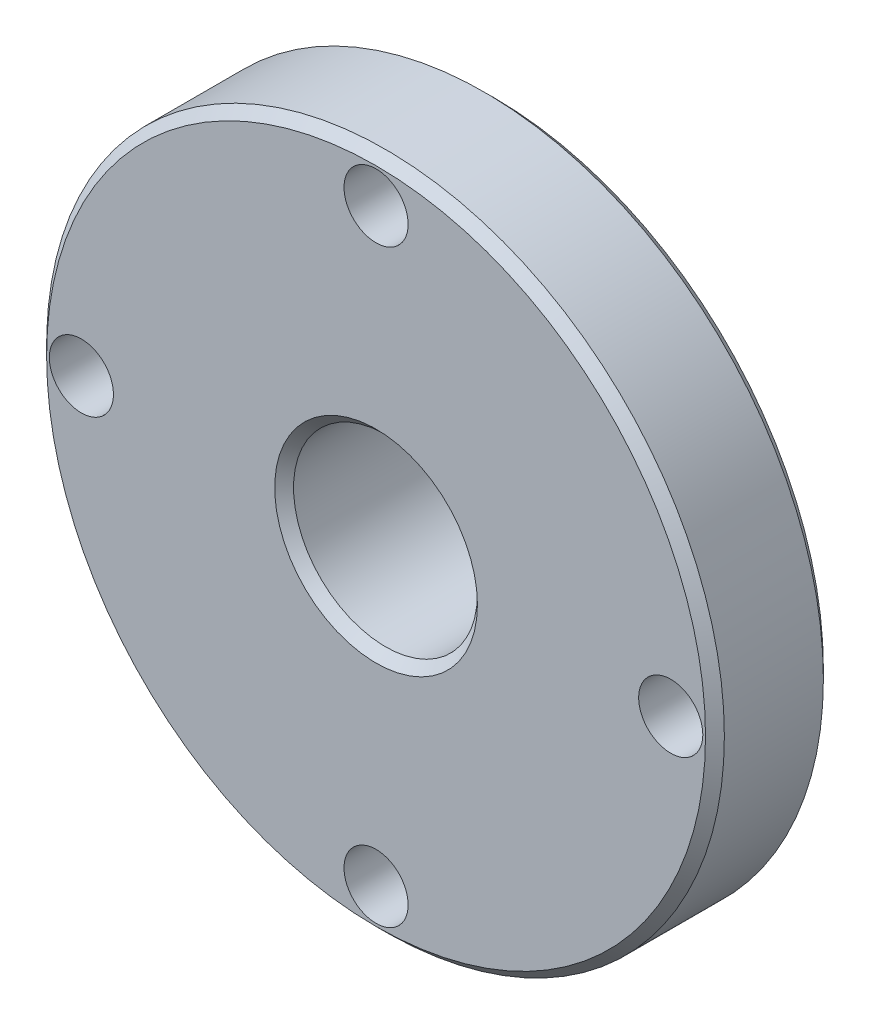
from build123d import *

# Parameters (mm, degrees)
SKETCH1_R          = 18.25625
EXTRUDE1_DEPTH     = 6.35
SKETCH2_R          = 1.7272
SCREW_HOLES_DEPTH  = 6.35
SKETCH3_R          = 4.953
CONN_HOLE_DEPTH    = 27.587663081
SKETCH4_R          = 9.4615
SKETCH4_R_2        = 4.953
LOCATOR_BOSS_DEPTH = 2.032
EDGES_2_SIZE       = 0.508


with BuildPart() as part:
    # Sketch1 → Extrude1 (new body)
    with BuildSketch(Plane.XY):
        Circle(SKETCH1_R)
    extrude(amount=EXTRUDE1_DEPTH)

    # Sketch2 → screw holes (cut)
    with BuildSketch(Plane.XY.offset(6.35)):
        with Locations((0, 15.875)):
            Circle(SKETCH2_R)
        with Locations((-15.875, 0)):
            Circle(SKETCH2_R)
        with Locations((0, -15.875)):
            Circle(SKETCH2_R)
        with Locations((15.875, 0)):
            Circle(SKETCH2_R)
    extrude(amount=-SCREW_HOLES_DEPTH, mode=Mode.SUBTRACT)

    # Sketch3 → conn hole (cut, through all)
    with BuildSketch(Plane.XY.offset(6.35)):
        Circle(SKETCH3_R)
    extrude(amount=-CONN_HOLE_DEPTH, mode=Mode.SUBTRACT)

    # Sketch4 → locator boss (add)
    with BuildSketch(Plane(origin=(0, 0, 0), x_dir=(-1, 0, 0), z_dir=(0, 0, -1))):
        with Locations(Location((0, 0, 0), (0, 0, 180))):
            Circle(SKETCH4_R)
        with Locations(Location((0, 0, 0), (0, 0, 180))):
            Circle(SKETCH4_R_2, mode=Mode.SUBTRACT)
    extrude(amount=LOCATOR_BOSS_DEPTH)

    # edges 2
    edges_2_edges = [part.edges().sort_by_distance(p)[0] for p in [
        (-18.25625, 0, 0),
        (-18.25625, 0, 6.35),
        (-4.953, 0, 6.35),
        (-9.4615, 0, -2.032),
        (-4.953, 0, -2.032),
    ]]
    chamfer(edges_2_edges, length=EDGES_2_SIZE)


solid = part.part
